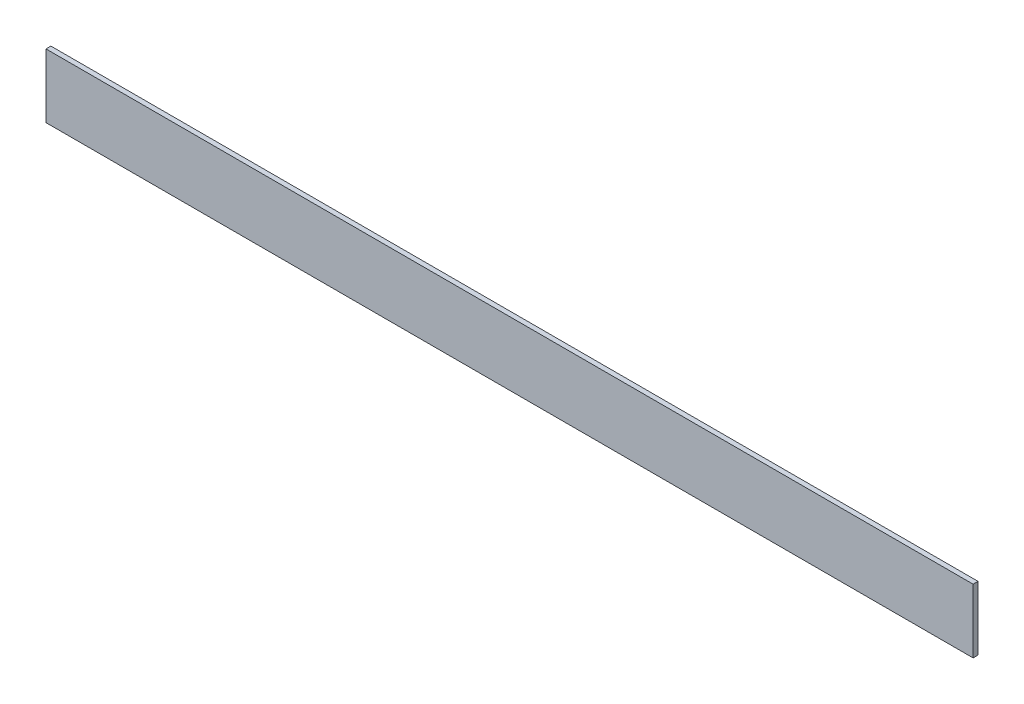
from build123d import *

# Parameters (mm, degrees)
SKETCH_1_W      = 566
SKETCH_1_H      = 39
EXTRUDE_1_DEPTH = 3


with BuildPart() as part:
    # Sketch 1 → Extrude 1 (new body)
    with BuildSketch(Plane.XY):
        Rectangle(SKETCH_1_W, SKETCH_1_H)
    extrude(amount=EXTRUDE_1_DEPTH)


solid = part.part
